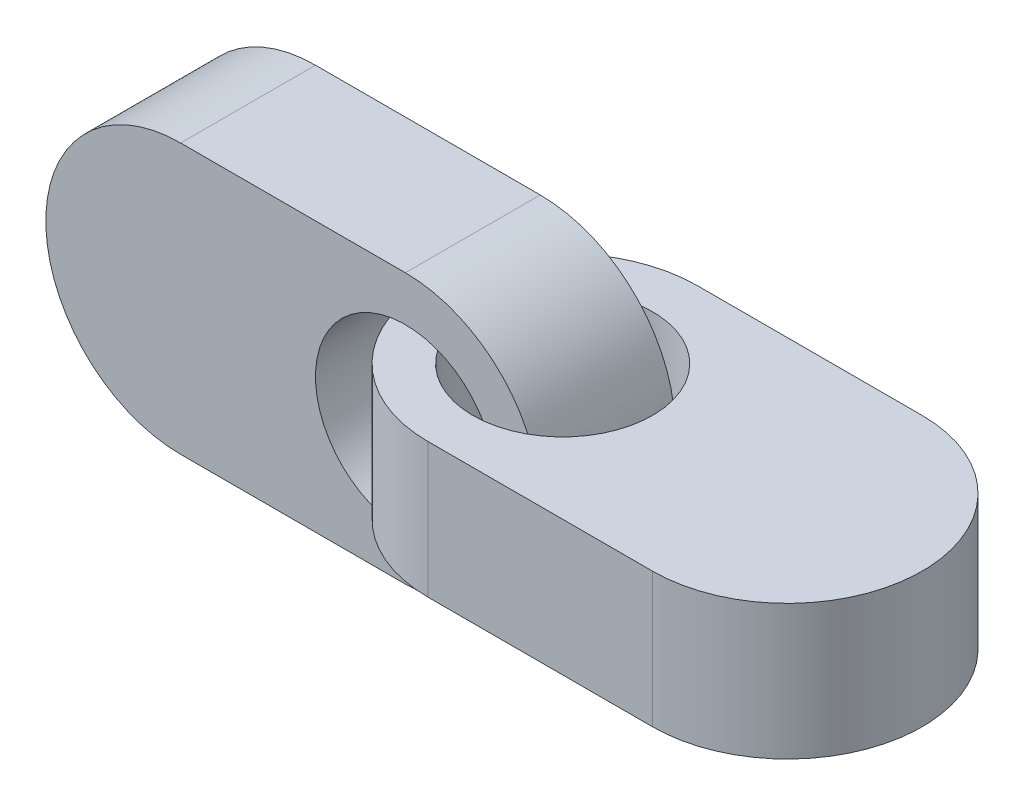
ISO-10303-21;
HEADER;
FILE_DESCRIPTION(('STEP AP214'),'2;1');
FILE_NAME('part.step','',(''),(''),'','','');
FILE_SCHEMA(('AUTOMOTIVE_DESIGN { 1 0 10303 214 1 1 1 1 }'));
ENDSEC;
DATA;
#1=APPLICATION_CONTEXT('core data for automotive mechanical design processes');
#2=APPLICATION_PROTOCOL_DEFINITION('international standard','automotive_design',2000,#1);
#3=PRODUCT_CONTEXT('',#1,'mechanical');
#4=PRODUCT('Part','Part','',(#3));
#5=PRODUCT_RELATED_PRODUCT_CATEGORY('part','',(#4));
#6=PRODUCT_DEFINITION_FORMATION('','',#4);
#7=PRODUCT_DEFINITION_CONTEXT('part definition',#1,'design');
#8=PRODUCT_DEFINITION('design','',#6,#7);
#9=PRODUCT_DEFINITION_SHAPE('','',#8);
#10=(LENGTH_UNIT() NAMED_UNIT(*) SI_UNIT(.MILLI.,.METRE.));
#11=(NAMED_UNIT(*) PLANE_ANGLE_UNIT() SI_UNIT($,.RADIAN.));
#12=(NAMED_UNIT(*) SI_UNIT($,.STERADIAN.) SOLID_ANGLE_UNIT());
#13=UNCERTAINTY_MEASURE_WITH_UNIT(LENGTH_MEASURE(1.E-05),#10,'distance_accuracy_value','');
#14=(GEOMETRIC_REPRESENTATION_CONTEXT(3) GLOBAL_UNCERTAINTY_ASSIGNED_CONTEXT((#13)) GLOBAL_UNIT_ASSIGNED_CONTEXT((#10,
#11,#12)) REPRESENTATION_CONTEXT('',''));
#15=CARTESIAN_POINT('',(0.,0.,0.));
#16=DIRECTION('',(0.,0.,1.));
#17=DIRECTION('',(1.,0.,0.));
#18=AXIS2_PLACEMENT_3D('',#15,#16,#17);
#19=CARTESIAN_POINT('',(2.,1.5,0.));
#20=DIRECTION('',(0.,1.,0.));
#21=DIRECTION('',(0.,0.,1.));
#22=AXIS2_PLACEMENT_3D('',#19,#20,#21);
#23=PLANE('',#22);
#24=CARTESIAN_POINT('',(2.,1.5,0.));
#25=DIRECTION('',(0.,1.,0.));
#26=DIRECTION('',(0.,0.,1.));
#27=AXIS2_PLACEMENT_3D('',#24,#25,#26);
#28=CIRCLE('',#27,3.);
#29=CARTESIAN_POINT('',(2.,1.5,-3.));
#30=VERTEX_POINT('',#29);
#31=CARTESIAN_POINT('',(2.,1.5,3.));
#32=VERTEX_POINT('',#31);
#33=EDGE_CURVE('E105',#30,#32,#28,.T.);
#34=ORIENTED_EDGE('',*,*,#33,.T.);
#35=DIRECTION('',(1.,0.,0.));
#36=VECTOR('',#35,1.);
#37=CARTESIAN_POINT('',(2.,1.5,3.));
#38=LINE('',#37,#36);
#39=CARTESIAN_POINT('',(7.,1.5,3.));
#40=VERTEX_POINT('',#39);
#41=EDGE_CURVE('E100',#32,#40,#38,.T.);
#42=ORIENTED_EDGE('',*,*,#41,.T.);
#43=CARTESIAN_POINT('',(7.,1.5,0.));
#44=DIRECTION('',(0.,1.,0.));
#45=DIRECTION('',(0.,0.,1.));
#46=AXIS2_PLACEMENT_3D('',#43,#44,#45);
#47=CIRCLE('',#46,3.);
#48=CARTESIAN_POINT('',(7.,1.5,-3.));
#49=VERTEX_POINT('',#48);
#50=EDGE_CURVE('E103',#40,#49,#47,.T.);
#51=ORIENTED_EDGE('',*,*,#50,.T.);
#52=DIRECTION('',(-1.,0.,0.));
#53=VECTOR('',#52,1.);
#54=CARTESIAN_POINT('',(2.,1.5,-3.));
#55=LINE('',#54,#53);
#56=EDGE_CURVE('E70',#49,#30,#55,.T.);
#57=ORIENTED_EDGE('',*,*,#56,.T.);
#58=EDGE_LOOP('',(#34,#42,#51,#57));
#59=FACE_BOUND('',#58,.T.);
#60=CARTESIAN_POINT('',(2.,1.5,0.));
#61=DIRECTION('',(0.,1.,0.));
#62=DIRECTION('',(0.,0.,1.));
#63=AXIS2_PLACEMENT_3D('',#60,#61,#62);
#64=CIRCLE('',#63,2.);
#65=CARTESIAN_POINT('',(2.,1.5,2.));
#66=VERTEX_POINT('',#65);
#67=EDGE_CURVE('E120',#66,#66,#64,.T.);
#68=ORIENTED_EDGE('',*,*,#67,.F.);
#69=EDGE_LOOP('',(#68));
#70=FACE_BOUND('',#69,.T.);
#71=ADVANCED_FACE('F53',(#59,#70),#23,.T.);
#72=CARTESIAN_POINT('',(2.,-1.5,0.));
#73=DIRECTION('',(0.,1.,0.));
#74=DIRECTION('',(0.,0.,1.));
#75=AXIS2_PLACEMENT_3D('',#72,#73,#74);
#76=PLANE('',#75);
#77=CARTESIAN_POINT('',(2.,-1.5,0.));
#78=DIRECTION('',(0.,1.,0.));
#79=DIRECTION('',(0.,0.,1.));
#80=AXIS2_PLACEMENT_3D('',#77,#78,#79);
#81=CIRCLE('',#80,3.);
#82=CARTESIAN_POINT('',(2.,-1.5,-3.));
#83=VERTEX_POINT('',#82);
#84=CARTESIAN_POINT('',(2.,-1.5,3.));
#85=VERTEX_POINT('',#84);
#86=EDGE_CURVE('E117',#83,#85,#81,.T.);
#87=ORIENTED_EDGE('',*,*,#86,.F.);
#88=DIRECTION('',(-1.,0.,0.));
#89=VECTOR('',#88,1.);
#90=CARTESIAN_POINT('',(2.,-1.5,-3.));
#91=LINE('',#90,#89);
#92=CARTESIAN_POINT('',(7.,-1.5,-3.));
#93=VERTEX_POINT('',#92);
#94=EDGE_CURVE('E93',#93,#83,#91,.T.);
#95=ORIENTED_EDGE('',*,*,#94,.F.);
#96=CARTESIAN_POINT('',(7.,-1.5,0.));
#97=DIRECTION('',(0.,1.,0.));
#98=DIRECTION('',(0.,0.,1.));
#99=AXIS2_PLACEMENT_3D('',#96,#97,#98);
#100=CIRCLE('',#99,3.);
#101=CARTESIAN_POINT('',(7.,-1.5,3.));
#102=VERTEX_POINT('',#101);
#103=EDGE_CURVE('E87',#102,#93,#100,.T.);
#104=ORIENTED_EDGE('',*,*,#103,.F.);
#105=DIRECTION('',(1.,0.,0.));
#106=VECTOR('',#105,1.);
#107=CARTESIAN_POINT('',(2.,-1.5,3.));
#108=LINE('',#107,#106);
#109=EDGE_CURVE('E109',#85,#102,#108,.T.);
#110=ORIENTED_EDGE('',*,*,#109,.F.);
#111=EDGE_LOOP('',(#87,#95,#104,#110));
#112=FACE_BOUND('',#111,.T.);
#113=CARTESIAN_POINT('',(2.,-1.5,0.));
#114=DIRECTION('',(0.,1.,0.));
#115=DIRECTION('',(0.,0.,1.));
#116=AXIS2_PLACEMENT_3D('',#113,#114,#115);
#117=CIRCLE('',#116,2.);
#118=CARTESIAN_POINT('',(2.,-1.5,2.));
#119=VERTEX_POINT('',#118);
#120=EDGE_CURVE('E132',#119,#119,#117,.T.);
#121=ORIENTED_EDGE('',*,*,#120,.T.);
#122=EDGE_LOOP('',(#121));
#123=FACE_BOUND('',#122,.T.);
#124=ADVANCED_FACE('F128',(#112,#123),#76,.F.);
#125=CARTESIAN_POINT('',(2.,1.5,0.));
#126=DIRECTION('',(0.,-1.,0.));
#127=DIRECTION('',(0.,0.,-1.));
#128=AXIS2_PLACEMENT_3D('',#125,#126,#127);
#129=CYLINDRICAL_SURFACE('',#128,3.);
#130=ORIENTED_EDGE('',*,*,#86,.T.);
#131=DIRECTION('',(0.,-1.,0.));
#132=VECTOR('',#131,1.);
#133=CARTESIAN_POINT('',(2.,1.5,3.));
#134=LINE('',#133,#132);
#135=EDGE_CURVE('E12',#32,#85,#134,.T.);
#136=ORIENTED_EDGE('',*,*,#135,.F.);
#137=ORIENTED_EDGE('',*,*,#33,.F.);
#138=DIRECTION('',(0.,-1.,0.));
#139=VECTOR('',#138,1.);
#140=CARTESIAN_POINT('',(2.,1.5,-3.));
#141=LINE('',#140,#139);
#142=EDGE_CURVE('E113',#30,#83,#141,.T.);
#143=ORIENTED_EDGE('',*,*,#142,.T.);
#144=EDGE_LOOP('',(#130,#136,#137,#143));
#145=FACE_BOUND('',#144,.T.);
#146=ADVANCED_FACE('F55',(#145),#129,.T.);
#147=CARTESIAN_POINT('',(2.,1.5,3.));
#148=DIRECTION('',(0.,0.,-1.));
#149=DIRECTION('',(-1.,0.,0.));
#150=AXIS2_PLACEMENT_3D('',#147,#148,#149);
#151=PLANE('',#150);
#152=ORIENTED_EDGE('',*,*,#109,.T.);
#153=DIRECTION('',(0.,-1.,0.));
#154=VECTOR('',#153,1.);
#155=CARTESIAN_POINT('',(7.,1.5,3.));
#156=LINE('',#155,#154);
#157=EDGE_CURVE('E62',#40,#102,#156,.T.);
#158=ORIENTED_EDGE('',*,*,#157,.F.);
#159=ORIENTED_EDGE('',*,*,#41,.F.);
#160=ORIENTED_EDGE('',*,*,#135,.T.);
#161=EDGE_LOOP('',(#152,#158,#159,#160));
#162=FACE_BOUND('',#161,.T.);
#163=ADVANCED_FACE('F108',(#162),#151,.F.);
#164=CARTESIAN_POINT('',(7.,1.5,0.));
#165=DIRECTION('',(0.,-1.,0.));
#166=DIRECTION('',(0.,0.,-1.));
#167=AXIS2_PLACEMENT_3D('',#164,#165,#166);
#168=CYLINDRICAL_SURFACE('',#167,3.);
#169=ORIENTED_EDGE('',*,*,#103,.T.);
#170=DIRECTION('',(0.,-1.,0.));
#171=VECTOR('',#170,1.);
#172=CARTESIAN_POINT('',(7.,1.5,-3.));
#173=LINE('',#172,#171);
#174=EDGE_CURVE('E110',#49,#93,#173,.T.);
#175=ORIENTED_EDGE('',*,*,#174,.F.);
#176=ORIENTED_EDGE('',*,*,#50,.F.);
#177=ORIENTED_EDGE('',*,*,#157,.T.);
#178=EDGE_LOOP('',(#169,#175,#176,#177));
#179=FACE_BOUND('',#178,.T.);
#180=ADVANCED_FACE('F111',(#179),#168,.T.);
#181=CARTESIAN_POINT('',(2.,1.5,-3.));
#182=DIRECTION('',(0.,0.,1.));
#183=DIRECTION('',(1.,0.,0.));
#184=AXIS2_PLACEMENT_3D('',#181,#182,#183);
#185=PLANE('',#184);
#186=ORIENTED_EDGE('',*,*,#94,.T.);
#187=ORIENTED_EDGE('',*,*,#142,.F.);
#188=ORIENTED_EDGE('',*,*,#56,.F.);
#189=ORIENTED_EDGE('',*,*,#174,.T.);
#190=EDGE_LOOP('',(#186,#187,#188,#189));
#191=FACE_BOUND('',#190,.T.);
#192=ADVANCED_FACE('F125',(#191),#185,.F.);
#193=CARTESIAN_POINT('',(2.,1.5,0.));
#194=DIRECTION('',(0.,-1.,0.));
#195=DIRECTION('',(0.,0.,-1.));
#196=AXIS2_PLACEMENT_3D('',#193,#194,#195);
#197=CYLINDRICAL_SURFACE('',#196,2.);
#198=ORIENTED_EDGE('',*,*,#67,.T.);
#199=EDGE_LOOP('',(#198));
#200=FACE_BOUND('',#199,.T.);
#201=ORIENTED_EDGE('',*,*,#120,.F.);
#202=EDGE_LOOP('',(#201));
#203=FACE_BOUND('',#202,.T.);
#204=ADVANCED_FACE('F138',(#200,#203),#197,.F.);
#205=CLOSED_SHELL('',(#71,#124,#146,#163,#180,#192,#204));
#206=MANIFOLD_SOLID_BREP('B2',#205);
#207=CARTESIAN_POINT('',(0.,0.,1.5));
#208=DIRECTION('',(0.,0.,1.));
#209=DIRECTION('',(1.,0.,0.));
#210=AXIS2_PLACEMENT_3D('',#207,#208,#209);
#211=PLANE('',#210);
#212=CARTESIAN_POINT('',(0.,0.,1.5));
#213=DIRECTION('',(0.,0.,1.));
#214=DIRECTION('',(1.,0.,0.));
#215=AXIS2_PLACEMENT_3D('',#212,#213,#214);
#216=CIRCLE('',#215,3.);
#217=CARTESIAN_POINT('',(0.,-3.,1.5));
#218=VERTEX_POINT('',#217);
#219=CARTESIAN_POINT('',(0.,3.,1.5));
#220=VERTEX_POINT('',#219);
#221=EDGE_CURVE('E250',#218,#220,#216,.T.);
#222=ORIENTED_EDGE('',*,*,#221,.T.);
#223=DIRECTION('',(-1.,0.,0.));
#224=VECTOR('',#223,1.);
#225=CARTESIAN_POINT('',(0.,3.,1.5));
#226=LINE('',#225,#224);
#227=CARTESIAN_POINT('',(-5.,3.,1.5));
#228=VERTEX_POINT('',#227);
#229=EDGE_CURVE('E245',#220,#228,#226,.T.);
#230=ORIENTED_EDGE('',*,*,#229,.T.);
#231=CARTESIAN_POINT('',(-5.,0.,1.5));
#232=DIRECTION('',(0.,0.,1.));
#233=DIRECTION('',(1.,0.,0.));
#234=AXIS2_PLACEMENT_3D('',#231,#232,#233);
#235=CIRCLE('',#234,3.);
#236=CARTESIAN_POINT('',(-5.,-3.,1.5));
#237=VERTEX_POINT('',#236);
#238=EDGE_CURVE('E248',#228,#237,#235,.T.);
#239=ORIENTED_EDGE('',*,*,#238,.T.);
#240=DIRECTION('',(1.,0.,0.));
#241=VECTOR('',#240,1.);
#242=CARTESIAN_POINT('',(0.,-3.,1.5));
#243=LINE('',#242,#241);
#244=EDGE_CURVE('E215',#237,#218,#243,.T.);
#245=ORIENTED_EDGE('',*,*,#244,.T.);
#246=EDGE_LOOP('',(#222,#230,#239,#245));
#247=FACE_BOUND('',#246,.T.);
#248=CARTESIAN_POINT('',(0.,0.,1.5));
#249=DIRECTION('',(0.,0.,1.));
#250=DIRECTION('',(1.,0.,0.));
#251=AXIS2_PLACEMENT_3D('',#248,#249,#250);
#252=CIRCLE('',#251,2.);
#253=CARTESIAN_POINT('',(2.,0.,1.5));
#254=VERTEX_POINT('',#253);
#255=EDGE_CURVE('E265',#254,#254,#252,.T.);
#256=ORIENTED_EDGE('',*,*,#255,.F.);
#257=EDGE_LOOP('',(#256));
#258=FACE_BOUND('',#257,.T.);
#259=ADVANCED_FACE('F198',(#247,#258),#211,.T.);
#260=CARTESIAN_POINT('',(0.,0.,-1.5));
#261=DIRECTION('',(0.,0.,1.));
#262=DIRECTION('',(1.,0.,0.));
#263=AXIS2_PLACEMENT_3D('',#260,#261,#262);
#264=PLANE('',#263);
#265=CARTESIAN_POINT('',(0.,0.,-1.5));
#266=DIRECTION('',(0.,0.,1.));
#267=DIRECTION('',(1.,0.,0.));
#268=AXIS2_PLACEMENT_3D('',#265,#266,#267);
#269=CIRCLE('',#268,3.);
#270=CARTESIAN_POINT('',(0.,-3.,-1.5));
#271=VERTEX_POINT('',#270);
#272=CARTESIAN_POINT('',(0.,3.,-1.5));
#273=VERTEX_POINT('',#272);
#274=EDGE_CURVE('E262',#271,#273,#269,.T.);
#275=ORIENTED_EDGE('',*,*,#274,.F.);
#276=DIRECTION('',(1.,0.,0.));
#277=VECTOR('',#276,1.);
#278=CARTESIAN_POINT('',(0.,-3.,-1.5));
#279=LINE('',#278,#277);
#280=CARTESIAN_POINT('',(-5.,-3.,-1.5));
#281=VERTEX_POINT('',#280);
#282=EDGE_CURVE('E238',#281,#271,#279,.T.);
#283=ORIENTED_EDGE('',*,*,#282,.F.);
#284=CARTESIAN_POINT('',(-5.,0.,-1.5));
#285=DIRECTION('',(0.,0.,1.));
#286=DIRECTION('',(1.,0.,0.));
#287=AXIS2_PLACEMENT_3D('',#284,#285,#286);
#288=CIRCLE('',#287,3.);
#289=CARTESIAN_POINT('',(-5.,3.,-1.5));
#290=VERTEX_POINT('',#289);
#291=EDGE_CURVE('E232',#290,#281,#288,.T.);
#292=ORIENTED_EDGE('',*,*,#291,.F.);
#293=DIRECTION('',(-1.,0.,0.));
#294=VECTOR('',#293,1.);
#295=CARTESIAN_POINT('',(0.,3.,-1.5));
#296=LINE('',#295,#294);
#297=EDGE_CURVE('E254',#273,#290,#296,.T.);
#298=ORIENTED_EDGE('',*,*,#297,.F.);
#299=EDGE_LOOP('',(#275,#283,#292,#298));
#300=FACE_BOUND('',#299,.T.);
#301=CARTESIAN_POINT('',(0.,0.,-1.5));
#302=DIRECTION('',(0.,0.,1.));
#303=DIRECTION('',(1.,0.,0.));
#304=AXIS2_PLACEMENT_3D('',#301,#302,#303);
#305=CIRCLE('',#304,2.);
#306=CARTESIAN_POINT('',(2.,0.,-1.5));
#307=VERTEX_POINT('',#306);
#308=EDGE_CURVE('E277',#307,#307,#305,.T.);
#309=ORIENTED_EDGE('',*,*,#308,.T.);
#310=EDGE_LOOP('',(#309));
#311=FACE_BOUND('',#310,.T.);
#312=ADVANCED_FACE('F273',(#300,#311),#264,.F.);
#313=CARTESIAN_POINT('',(0.,0.,1.5));
#314=DIRECTION('',(0.,0.,-1.));
#315=DIRECTION('',(-1.,0.,0.));
#316=AXIS2_PLACEMENT_3D('',#313,#314,#315);
#317=CYLINDRICAL_SURFACE('',#316,3.);
#318=ORIENTED_EDGE('',*,*,#274,.T.);
#319=DIRECTION('',(0.,0.,-1.));
#320=VECTOR('',#319,1.);
#321=CARTESIAN_POINT('',(0.,3.,1.5));
#322=LINE('',#321,#320);
#323=EDGE_CURVE('E51',#220,#273,#322,.T.);
#324=ORIENTED_EDGE('',*,*,#323,.F.);
#325=ORIENTED_EDGE('',*,*,#221,.F.);
#326=DIRECTION('',(0.,0.,-1.));
#327=VECTOR('',#326,1.);
#328=CARTESIAN_POINT('',(0.,-3.,1.5));
#329=LINE('',#328,#327);
#330=EDGE_CURVE('E258',#218,#271,#329,.T.);
#331=ORIENTED_EDGE('',*,*,#330,.T.);
#332=EDGE_LOOP('',(#318,#324,#325,#331));
#333=FACE_BOUND('',#332,.T.);
#334=ADVANCED_FACE('F200',(#333),#317,.T.);
#335=CARTESIAN_POINT('',(0.,3.,1.5));
#336=DIRECTION('',(0.,-1.,0.));
#337=DIRECTION('',(1.,0.,0.));
#338=AXIS2_PLACEMENT_3D('',#335,#336,#337);
#339=PLANE('',#338);
#340=ORIENTED_EDGE('',*,*,#297,.T.);
#341=DIRECTION('',(0.,0.,-1.));
#342=VECTOR('',#341,1.);
#343=CARTESIAN_POINT('',(-5.,3.,1.5));
#344=LINE('',#343,#342);
#345=EDGE_CURVE('E207',#228,#290,#344,.T.);
#346=ORIENTED_EDGE('',*,*,#345,.F.);
#347=ORIENTED_EDGE('',*,*,#229,.F.);
#348=ORIENTED_EDGE('',*,*,#323,.T.);
#349=EDGE_LOOP('',(#340,#346,#347,#348));
#350=FACE_BOUND('',#349,.T.);
#351=ADVANCED_FACE('F253',(#350),#339,.F.);
#352=CARTESIAN_POINT('',(-5.,0.,1.5));
#353=DIRECTION('',(0.,0.,-1.));
#354=DIRECTION('',(-1.,0.,0.));
#355=AXIS2_PLACEMENT_3D('',#352,#353,#354);
#356=CYLINDRICAL_SURFACE('',#355,3.);
#357=ORIENTED_EDGE('',*,*,#291,.T.);
#358=DIRECTION('',(0.,0.,-1.));
#359=VECTOR('',#358,1.);
#360=CARTESIAN_POINT('',(-5.,-3.,1.5));
#361=LINE('',#360,#359);
#362=EDGE_CURVE('E255',#237,#281,#361,.T.);
#363=ORIENTED_EDGE('',*,*,#362,.F.);
#364=ORIENTED_EDGE('',*,*,#238,.F.);
#365=ORIENTED_EDGE('',*,*,#345,.T.);
#366=EDGE_LOOP('',(#357,#363,#364,#365));
#367=FACE_BOUND('',#366,.T.);
#368=ADVANCED_FACE('F256',(#367),#356,.T.);
#369=CARTESIAN_POINT('',(0.,-3.,1.5));
#370=DIRECTION('',(0.,1.,0.));
#371=DIRECTION('',(-1.,0.,0.));
#372=AXIS2_PLACEMENT_3D('',#369,#370,#371);
#373=PLANE('',#372);
#374=ORIENTED_EDGE('',*,*,#282,.T.);
#375=ORIENTED_EDGE('',*,*,#330,.F.);
#376=ORIENTED_EDGE('',*,*,#244,.F.);
#377=ORIENTED_EDGE('',*,*,#362,.T.);
#378=EDGE_LOOP('',(#374,#375,#376,#377));
#379=FACE_BOUND('',#378,.T.);
#380=ADVANCED_FACE('F270',(#379),#373,.F.);
#381=CARTESIAN_POINT('',(0.,0.,1.5));
#382=DIRECTION('',(0.,0.,-1.));
#383=DIRECTION('',(-1.,0.,0.));
#384=AXIS2_PLACEMENT_3D('',#381,#382,#383);
#385=CYLINDRICAL_SURFACE('',#384,2.);
#386=ORIENTED_EDGE('',*,*,#255,.T.);
#387=EDGE_LOOP('',(#386));
#388=FACE_BOUND('',#387,.T.);
#389=ORIENTED_EDGE('',*,*,#308,.F.);
#390=EDGE_LOOP('',(#389));
#391=FACE_BOUND('',#390,.T.);
#392=ADVANCED_FACE('F283',(#388,#391),#385,.F.);
#393=CLOSED_SHELL('',(#259,#312,#334,#351,#368,#380,#392));
#394=MANIFOLD_SOLID_BREP('B6',#393);
#395=ADVANCED_BREP_SHAPE_REPRESENTATION('',(#18,#206,#394),#14);
#396=SHAPE_DEFINITION_REPRESENTATION(#9,#395);
ENDSEC;
END-ISO-10303-21;
